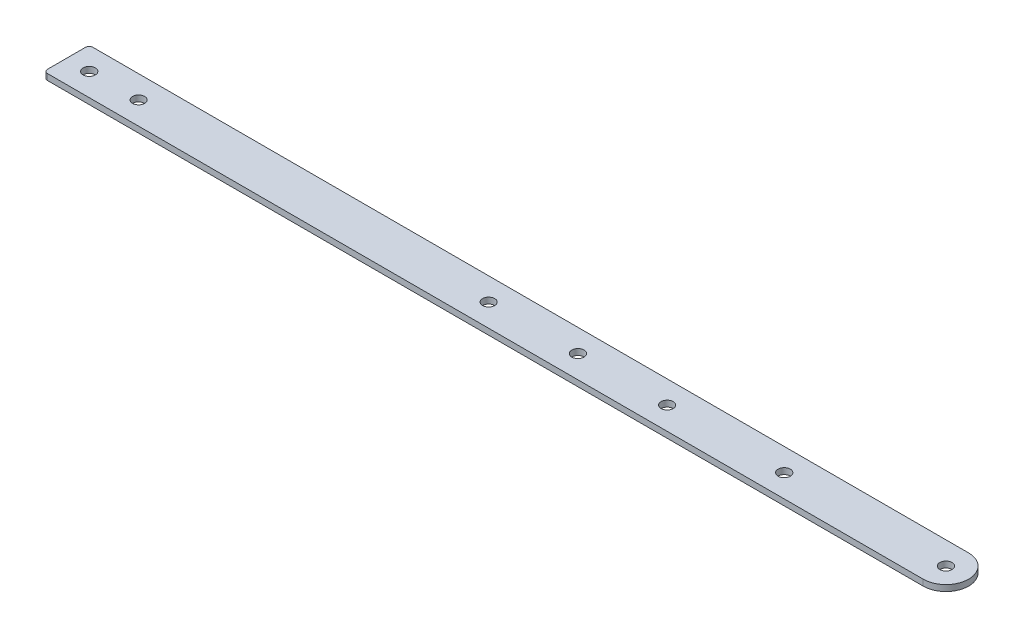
ISO-10303-21;
HEADER;
FILE_DESCRIPTION(('STEP AP214'),'2;1');
FILE_NAME('part.step','',(''),(''),'','','');
FILE_SCHEMA(('AUTOMOTIVE_DESIGN { 1 0 10303 214 1 1 1 1 }'));
ENDSEC;
DATA;
#1=APPLICATION_CONTEXT('core data for automotive mechanical design processes');
#2=APPLICATION_PROTOCOL_DEFINITION('international standard','automotive_design',2000,#1);
#3=PRODUCT_CONTEXT('',#1,'mechanical');
#4=PRODUCT('Part','Part','',(#3));
#5=PRODUCT_RELATED_PRODUCT_CATEGORY('part','',(#4));
#6=PRODUCT_DEFINITION_FORMATION('','',#4);
#7=PRODUCT_DEFINITION_CONTEXT('part definition',#1,'design');
#8=PRODUCT_DEFINITION('design','',#6,#7);
#9=PRODUCT_DEFINITION_SHAPE('','',#8);
#10=(LENGTH_UNIT() NAMED_UNIT(*) SI_UNIT(.MILLI.,.METRE.));
#11=(NAMED_UNIT(*) PLANE_ANGLE_UNIT() SI_UNIT($,.RADIAN.));
#12=(NAMED_UNIT(*) SI_UNIT($,.STERADIAN.) SOLID_ANGLE_UNIT());
#13=UNCERTAINTY_MEASURE_WITH_UNIT(LENGTH_MEASURE(1.E-05),#10,'distance_accuracy_value','');
#14=(GEOMETRIC_REPRESENTATION_CONTEXT(3) GLOBAL_UNCERTAINTY_ASSIGNED_CONTEXT((#13)) GLOBAL_UNIT_ASSIGNED_CONTEXT((#10,
#11,#12)) REPRESENTATION_CONTEXT('',''));
#15=CARTESIAN_POINT('',(0.,0.,0.));
#16=DIRECTION('',(0.,0.,1.));
#17=DIRECTION('',(1.,0.,0.));
#18=AXIS2_PLACEMENT_3D('',#15,#16,#17);
#19=CARTESIAN_POINT('',(1483.56169288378,4.,2004.05334639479));
#20=DIRECTION('',(0.,1.,0.));
#21=DIRECTION('',(0.,0.,-1.));
#22=AXIS2_PLACEMENT_3D('',#19,#20,#21);
#23=PLANE('',#22);
#24=CARTESIAN_POINT('',(1877.67003879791,4.,2016.55334639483));
#25=DIRECTION('',(0.,-1.,0.));
#26=DIRECTION('',(0.,0.,-1.));
#27=AXIS2_PLACEMENT_3D('',#24,#25,#26);
#28=CIRCLE('',#27,3.99999999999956);
#29=CARTESIAN_POINT('',(1877.67003879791,4.,2012.55334639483));
#30=VERTEX_POINT('',#29);
#31=EDGE_CURVE('E176',#30,#30,#28,.T.);
#32=ORIENTED_EDGE('',*,*,#31,.T.);
#33=EDGE_LOOP('',(#32));
#34=FACE_BOUND('',#33,.T.);
#35=CARTESIAN_POINT('',(1954.97920122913,4.,2016.55334639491));
#36=DIRECTION('',(0.,-1.,0.));
#37=DIRECTION('',(0.,0.,-1.));
#38=AXIS2_PLACEMENT_3D('',#35,#36,#37);
#39=CIRCLE('',#38,4.05000000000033);
#40=CARTESIAN_POINT('',(1954.97920122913,4.,2012.50334639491));
#41=VERTEX_POINT('',#40);
#42=EDGE_CURVE('E164',#41,#41,#39,.T.);
#43=ORIENTED_EDGE('',*,*,#42,.T.);
#44=EDGE_LOOP('',(#43));
#45=FACE_BOUND('',#44,.T.);
#46=CARTESIAN_POINT('',(1496.06169288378,4.,2016.5533463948));
#47=DIRECTION('',(0.,-1.,0.));
#48=DIRECTION('',(0.,0.,-1.));
#49=AXIS2_PLACEMENT_3D('',#46,#47,#48);
#50=CIRCLE('',#49,4.04999999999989);
#51=CARTESIAN_POINT('',(1496.06169288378,4.,2012.5033463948));
#52=VERTEX_POINT('',#51);
#53=EDGE_CURVE('E152',#52,#52,#50,.T.);
#54=ORIENTED_EDGE('',*,*,#53,.T.);
#55=EDGE_LOOP('',(#54));
#56=FACE_BOUND('',#55,.T.);
#57=CARTESIAN_POINT('',(1483.56169288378,4.,2004.05334639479));
#58=DIRECTION('',(0.,-1.,0.));
#59=DIRECTION('',(0.,0.,-1.));
#60=AXIS2_PLACEMENT_3D('',#57,#58,#59);
#61=CIRCLE('',#60,2.49999999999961);
#62=CARTESIAN_POINT('',(1481.06169288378,4.,2004.05334639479));
#63=VERTEX_POINT('',#62);
#64=CARTESIAN_POINT('',(1483.56169288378,4.,2001.55334639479));
#65=VERTEX_POINT('',#64);
#66=EDGE_CURVE('E135',#63,#65,#61,.T.);
#67=ORIENTED_EDGE('',*,*,#66,.F.);
#68=DIRECTION('',(0.,0.,-1.));
#69=VECTOR('',#68,1.);
#70=CARTESIAN_POINT('',(1481.06169288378,4.,2004.05334639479));
#71=LINE('',#70,#69);
#72=CARTESIAN_POINT('',(1481.06169288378,4.,2029.05334641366));
#73=VERTEX_POINT('',#72);
#74=EDGE_CURVE('E115',#73,#63,#71,.T.);
#75=ORIENTED_EDGE('',*,*,#74,.F.);
#76=CARTESIAN_POINT('',(1483.56169288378,4.,2029.05334641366));
#77=DIRECTION('',(0.,-1.,0.));
#78=DIRECTION('',(0.,0.,-1.));
#79=AXIS2_PLACEMENT_3D('',#76,#77,#78);
#80=CIRCLE('',#79,2.50000000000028);
#81=CARTESIAN_POINT('',(1483.56169288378,4.,2031.55334641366));
#82=VERTEX_POINT('',#81);
#83=EDGE_CURVE('E96',#82,#73,#80,.T.);
#84=ORIENTED_EDGE('',*,*,#83,.F.);
#85=DIRECTION('',(-1.,0.,0.));
#86=VECTOR('',#85,1.);
#87=CARTESIAN_POINT('',(1483.56169288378,4.,2031.55334641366));
#88=LINE('',#87,#86);
#89=CARTESIAN_POINT('',(2061.74711781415,4.,2031.55334641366));
#90=VERTEX_POINT('',#89);
#91=EDGE_CURVE('E106',#90,#82,#88,.T.);
#92=ORIENTED_EDGE('',*,*,#91,.F.);
#93=CARTESIAN_POINT('',(2061.74711782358,4.,2016.55334640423));
#94=DIRECTION('',(0.,-1.,0.));
#95=DIRECTION('',(0.,0.,-1.));
#96=AXIS2_PLACEMENT_3D('',#93,#94,#95);
#97=CIRCLE('',#96,15.0000000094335);
#98=CARTESIAN_POINT('',(2061.74711783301,4.,2001.55334639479));
#99=VERTEX_POINT('',#98);
#100=EDGE_CURVE('E111',#99,#90,#97,.T.);
#101=ORIENTED_EDGE('',*,*,#100,.F.);
#102=DIRECTION('',(1.,0.,0.));
#103=VECTOR('',#102,1.);
#104=CARTESIAN_POINT('',(1483.56169288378,4.,2001.55334639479));
#105=LINE('',#104,#103);
#106=EDGE_CURVE('E140',#65,#99,#105,.T.);
#107=ORIENTED_EDGE('',*,*,#106,.F.);
#108=EDGE_LOOP('',(#67,#75,#84,#92,#101,#107));
#109=FACE_BOUND('',#108,.T.);
#110=CARTESIAN_POINT('',(1528.6669663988,4.,2016.553346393));
#111=DIRECTION('',(0.,-1.,0.));
#112=DIRECTION('',(0.,0.,-1.));
#113=AXIS2_PLACEMENT_3D('',#110,#111,#112);
#114=CIRCLE('',#113,3.99999999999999);
#115=CARTESIAN_POINT('',(1528.6669663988,4.,2012.553346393));
#116=VERTEX_POINT('',#115);
#117=EDGE_CURVE('E124',#116,#116,#114,.T.);
#118=ORIENTED_EDGE('',*,*,#117,.T.);
#119=EDGE_LOOP('',(#118));
#120=FACE_BOUND('',#119,.T.);
#121=CARTESIAN_POINT('',(2061.74711782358,4.,2016.55334640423));
#122=DIRECTION('',(0.,-1.,0.));
#123=DIRECTION('',(0.,0.,-1.));
#124=AXIS2_PLACEMENT_3D('',#121,#122,#123);
#125=CIRCLE('',#124,4.04999999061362);
#126=CARTESIAN_POINT('',(2061.74711782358,4.,2012.50334641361));
#127=VERTEX_POINT('',#126);
#128=EDGE_CURVE('E158',#127,#127,#125,.T.);
#129=ORIENTED_EDGE('',*,*,#128,.T.);
#130=EDGE_LOOP('',(#129));
#131=FACE_BOUND('',#130,.T.);
#132=CARTESIAN_POINT('',(1818.75253045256,4.,2016.55334639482));
#133=DIRECTION('',(0.,-1.,0.));
#134=DIRECTION('',(0.,0.,-1.));
#135=AXIS2_PLACEMENT_3D('',#132,#133,#134);
#136=CIRCLE('',#135,4.04999999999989);
#137=CARTESIAN_POINT('',(1818.75253045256,4.,2012.50334639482));
#138=VERTEX_POINT('',#137);
#139=EDGE_CURVE('E170',#138,#138,#136,.T.);
#140=ORIENTED_EDGE('',*,*,#139,.T.);
#141=EDGE_LOOP('',(#140));
#142=FACE_BOUND('',#141,.T.);
#143=CARTESIAN_POINT('',(1759.83502210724,4.,2016.55334639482));
#144=DIRECTION('',(0.,-1.,0.));
#145=DIRECTION('',(0.,0.,-1.));
#146=AXIS2_PLACEMENT_3D('',#143,#144,#145);
#147=CIRCLE('',#146,4.);
#148=CARTESIAN_POINT('',(1759.83502210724,4.,2012.55334639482));
#149=VERTEX_POINT('',#148);
#150=EDGE_CURVE('E182',#149,#149,#147,.T.);
#151=ORIENTED_EDGE('',*,*,#150,.T.);
#152=EDGE_LOOP('',(#151));
#153=FACE_BOUND('',#152,.T.);
#154=ADVANCED_FACE('F35',(#34,#45,#56,#109,#120,#131,#142,#153),#23,.T.);
#155=CARTESIAN_POINT('',(1483.56169288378,0.,2004.05334639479));
#156=DIRECTION('',(0.,1.,0.));
#157=DIRECTION('',(0.,0.,-1.));
#158=AXIS2_PLACEMENT_3D('',#155,#156,#157);
#159=PLANE('',#158);
#160=CARTESIAN_POINT('',(1877.67003879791,0.,2016.55334639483));
#161=DIRECTION('',(0.,-1.,0.));
#162=DIRECTION('',(0.,0.,-1.));
#163=AXIS2_PLACEMENT_3D('',#160,#161,#162);
#164=CIRCLE('',#163,3.99999999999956);
#165=CARTESIAN_POINT('',(1877.67003879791,0.,2012.55334639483));
#166=VERTEX_POINT('',#165);
#167=EDGE_CURVE('E179',#166,#166,#164,.T.);
#168=ORIENTED_EDGE('',*,*,#167,.F.);
#169=EDGE_LOOP('',(#168));
#170=FACE_BOUND('',#169,.T.);
#171=CARTESIAN_POINT('',(1954.97920122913,0.,2016.55334639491));
#172=DIRECTION('',(0.,-1.,0.));
#173=DIRECTION('',(0.,0.,-1.));
#174=AXIS2_PLACEMENT_3D('',#171,#172,#173);
#175=CIRCLE('',#174,4.05000000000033);
#176=CARTESIAN_POINT('',(1954.97920122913,0.,2012.50334639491));
#177=VERTEX_POINT('',#176);
#178=EDGE_CURVE('E167',#177,#177,#175,.T.);
#179=ORIENTED_EDGE('',*,*,#178,.F.);
#180=EDGE_LOOP('',(#179));
#181=FACE_BOUND('',#180,.T.);
#182=CARTESIAN_POINT('',(1496.06169288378,0.,2016.5533463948));
#183=DIRECTION('',(0.,-1.,0.));
#184=DIRECTION('',(0.,0.,-1.));
#185=AXIS2_PLACEMENT_3D('',#182,#183,#184);
#186=CIRCLE('',#185,4.04999999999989);
#187=CARTESIAN_POINT('',(1496.06169288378,0.,2012.5033463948));
#188=VERTEX_POINT('',#187);
#189=EDGE_CURVE('E155',#188,#188,#186,.T.);
#190=ORIENTED_EDGE('',*,*,#189,.F.);
#191=EDGE_LOOP('',(#190));
#192=FACE_BOUND('',#191,.T.);
#193=CARTESIAN_POINT('',(1483.56169288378,0.,2004.05334639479));
#194=DIRECTION('',(0.,-1.,0.));
#195=DIRECTION('',(0.,0.,-1.));
#196=AXIS2_PLACEMENT_3D('',#193,#194,#195);
#197=CIRCLE('',#196,2.49999999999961);
#198=CARTESIAN_POINT('',(1481.06169288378,0.,2004.05334639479));
#199=VERTEX_POINT('',#198);
#200=CARTESIAN_POINT('',(1483.56169288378,0.,2001.55334639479));
#201=VERTEX_POINT('',#200);
#202=EDGE_CURVE('E120',#199,#201,#197,.T.);
#203=ORIENTED_EDGE('',*,*,#202,.T.);
#204=DIRECTION('',(1.,0.,0.));
#205=VECTOR('',#204,1.);
#206=CARTESIAN_POINT('',(1483.56169288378,0.,2001.55334639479));
#207=LINE('',#206,#205);
#208=CARTESIAN_POINT('',(2061.74711783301,0.,2001.55334639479));
#209=VERTEX_POINT('',#208);
#210=EDGE_CURVE('E123',#201,#209,#207,.T.);
#211=ORIENTED_EDGE('',*,*,#210,.T.);
#212=CARTESIAN_POINT('',(2061.74711782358,0.,2016.55334640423));
#213=DIRECTION('',(0.,-1.,0.));
#214=DIRECTION('',(0.,0.,-1.));
#215=AXIS2_PLACEMENT_3D('',#212,#213,#214);
#216=CIRCLE('',#215,15.0000000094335);
#217=CARTESIAN_POINT('',(2061.74711781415,0.,2031.55334641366));
#218=VERTEX_POINT('',#217);
#219=EDGE_CURVE('E127',#209,#218,#216,.T.);
#220=ORIENTED_EDGE('',*,*,#219,.T.);
#221=DIRECTION('',(-1.,0.,0.));
#222=VECTOR('',#221,1.);
#223=CARTESIAN_POINT('',(1483.56169288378,0.,2031.55334641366));
#224=LINE('',#223,#222);
#225=CARTESIAN_POINT('',(1483.56169288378,0.,2031.55334641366));
#226=VERTEX_POINT('',#225);
#227=EDGE_CURVE('E130',#218,#226,#224,.T.);
#228=ORIENTED_EDGE('',*,*,#227,.T.);
#229=CARTESIAN_POINT('',(1483.56169288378,0.,2029.05334641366));
#230=DIRECTION('',(0.,-1.,0.));
#231=DIRECTION('',(0.,0.,-1.));
#232=AXIS2_PLACEMENT_3D('',#229,#230,#231);
#233=CIRCLE('',#232,2.50000000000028);
#234=CARTESIAN_POINT('',(1481.06169288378,0.,2029.05334641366));
#235=VERTEX_POINT('',#234);
#236=EDGE_CURVE('E99',#226,#235,#233,.T.);
#237=ORIENTED_EDGE('',*,*,#236,.T.);
#238=DIRECTION('',(0.,0.,-1.));
#239=VECTOR('',#238,1.);
#240=CARTESIAN_POINT('',(1481.06169288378,0.,2004.05334639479));
#241=LINE('',#240,#239);
#242=EDGE_CURVE('E133',#235,#199,#241,.T.);
#243=ORIENTED_EDGE('',*,*,#242,.T.);
#244=EDGE_LOOP('',(#203,#211,#220,#228,#237,#243));
#245=FACE_BOUND('',#244,.T.);
#246=CARTESIAN_POINT('',(1528.6669663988,0.,2016.553346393));
#247=DIRECTION('',(0.,-1.,0.));
#248=DIRECTION('',(0.,0.,-1.));
#249=AXIS2_PLACEMENT_3D('',#246,#247,#248);
#250=CIRCLE('',#249,3.99999999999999);
#251=CARTESIAN_POINT('',(1528.6669663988,0.,2012.553346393));
#252=VERTEX_POINT('',#251);
#253=EDGE_CURVE('E149',#252,#252,#250,.T.);
#254=ORIENTED_EDGE('',*,*,#253,.F.);
#255=EDGE_LOOP('',(#254));
#256=FACE_BOUND('',#255,.T.);
#257=CARTESIAN_POINT('',(2061.74711782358,0.,2016.55334640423));
#258=DIRECTION('',(0.,-1.,0.));
#259=DIRECTION('',(0.,0.,-1.));
#260=AXIS2_PLACEMENT_3D('',#257,#258,#259);
#261=CIRCLE('',#260,4.04999999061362);
#262=CARTESIAN_POINT('',(2061.74711782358,0.,2012.50334641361));
#263=VERTEX_POINT('',#262);
#264=EDGE_CURVE('E161',#263,#263,#261,.T.);
#265=ORIENTED_EDGE('',*,*,#264,.F.);
#266=EDGE_LOOP('',(#265));
#267=FACE_BOUND('',#266,.T.);
#268=CARTESIAN_POINT('',(1818.75253045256,0.,2016.55334639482));
#269=DIRECTION('',(0.,-1.,0.));
#270=DIRECTION('',(0.,0.,-1.));
#271=AXIS2_PLACEMENT_3D('',#268,#269,#270);
#272=CIRCLE('',#271,4.04999999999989);
#273=CARTESIAN_POINT('',(1818.75253045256,0.,2012.50334639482));
#274=VERTEX_POINT('',#273);
#275=EDGE_CURVE('E173',#274,#274,#272,.T.);
#276=ORIENTED_EDGE('',*,*,#275,.F.);
#277=EDGE_LOOP('',(#276));
#278=FACE_BOUND('',#277,.T.);
#279=CARTESIAN_POINT('',(1759.83502210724,0.,2016.55334639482));
#280=DIRECTION('',(0.,-1.,0.));
#281=DIRECTION('',(0.,0.,-1.));
#282=AXIS2_PLACEMENT_3D('',#279,#280,#281);
#283=CIRCLE('',#282,4.);
#284=CARTESIAN_POINT('',(1759.83502210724,0.,2012.55334639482));
#285=VERTEX_POINT('',#284);
#286=EDGE_CURVE('E185',#285,#285,#283,.T.);
#287=ORIENTED_EDGE('',*,*,#286,.F.);
#288=EDGE_LOOP('',(#287));
#289=FACE_BOUND('',#288,.T.);
#290=ADVANCED_FACE('F144',(#170,#181,#192,#245,#256,#267,#278,#289),#159,.F.);
#291=CARTESIAN_POINT('',(1483.56169288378,4.,2004.05334639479));
#292=DIRECTION('',(0.,-1.,0.));
#293=DIRECTION('',(0.,0.,1.));
#294=AXIS2_PLACEMENT_3D('',#291,#292,#293);
#295=CYLINDRICAL_SURFACE('',#294,2.49999999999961);
#296=ORIENTED_EDGE('',*,*,#202,.F.);
#297=DIRECTION('',(0.,-1.,0.));
#298=VECTOR('',#297,1.);
#299=CARTESIAN_POINT('',(1481.06169288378,4.,2004.05334639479));
#300=LINE('',#299,#298);
#301=EDGE_CURVE('E52',#63,#199,#300,.T.);
#302=ORIENTED_EDGE('',*,*,#301,.F.);
#303=ORIENTED_EDGE('',*,*,#66,.T.);
#304=DIRECTION('',(0.,-1.,0.));
#305=VECTOR('',#304,1.);
#306=CARTESIAN_POINT('',(1483.56169288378,4.,2001.55334639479));
#307=LINE('',#306,#305);
#308=EDGE_CURVE('E11',#65,#201,#307,.T.);
#309=ORIENTED_EDGE('',*,*,#308,.T.);
#310=EDGE_LOOP('',(#296,#302,#303,#309));
#311=FACE_BOUND('',#310,.T.);
#312=ADVANCED_FACE('F37',(#311),#295,.T.);
#313=CARTESIAN_POINT('',(1483.56169288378,4.,2001.55334639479));
#314=DIRECTION('',(0.,0.,1.));
#315=DIRECTION('',(-1.,0.,0.));
#316=AXIS2_PLACEMENT_3D('',#313,#314,#315);
#317=PLANE('',#316);
#318=ORIENTED_EDGE('',*,*,#210,.F.);
#319=ORIENTED_EDGE('',*,*,#308,.F.);
#320=ORIENTED_EDGE('',*,*,#106,.T.);
#321=DIRECTION('',(0.,-1.,0.));
#322=VECTOR('',#321,1.);
#323=CARTESIAN_POINT('',(2061.74711783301,4.,2001.55334639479));
#324=LINE('',#323,#322);
#325=EDGE_CURVE('E44',#99,#209,#324,.T.);
#326=ORIENTED_EDGE('',*,*,#325,.T.);
#327=EDGE_LOOP('',(#318,#319,#320,#326));
#328=FACE_BOUND('',#327,.T.);
#329=ADVANCED_FACE('F139',(#328),#317,.F.);
#330=CARTESIAN_POINT('',(2061.74711782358,4.,2016.55334640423));
#331=DIRECTION('',(0.,-1.,0.));
#332=DIRECTION('',(0.,0.,1.));
#333=AXIS2_PLACEMENT_3D('',#330,#331,#332);
#334=CYLINDRICAL_SURFACE('',#333,15.0000000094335);
#335=ORIENTED_EDGE('',*,*,#219,.F.);
#336=ORIENTED_EDGE('',*,*,#325,.F.);
#337=ORIENTED_EDGE('',*,*,#100,.T.);
#338=DIRECTION('',(0.,-1.,0.));
#339=VECTOR('',#338,1.);
#340=CARTESIAN_POINT('',(2061.74711781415,4.,2031.55334641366));
#341=LINE('',#340,#339);
#342=EDGE_CURVE('E103',#90,#218,#341,.T.);
#343=ORIENTED_EDGE('',*,*,#342,.T.);
#344=EDGE_LOOP('',(#335,#336,#337,#343));
#345=FACE_BOUND('',#344,.T.);
#346=ADVANCED_FACE('F142',(#345),#334,.T.);
#347=CARTESIAN_POINT('',(1483.56169288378,4.,2031.55334641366));
#348=DIRECTION('',(0.,0.,-1.));
#349=DIRECTION('',(1.,0.,0.));
#350=AXIS2_PLACEMENT_3D('',#347,#348,#349);
#351=PLANE('',#350);
#352=ORIENTED_EDGE('',*,*,#227,.F.);
#353=ORIENTED_EDGE('',*,*,#342,.F.);
#354=ORIENTED_EDGE('',*,*,#91,.T.);
#355=DIRECTION('',(0.,-1.,0.));
#356=VECTOR('',#355,1.);
#357=CARTESIAN_POINT('',(1483.56169288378,4.,2031.55334641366));
#358=LINE('',#357,#356);
#359=EDGE_CURVE('E92',#82,#226,#358,.T.);
#360=ORIENTED_EDGE('',*,*,#359,.T.);
#361=EDGE_LOOP('',(#352,#353,#354,#360));
#362=FACE_BOUND('',#361,.T.);
#363=ADVANCED_FACE('F107',(#362),#351,.F.);
#364=CARTESIAN_POINT('',(1483.56169288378,4.,2029.05334641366));
#365=DIRECTION('',(0.,-1.,0.));
#366=DIRECTION('',(0.,0.,1.));
#367=AXIS2_PLACEMENT_3D('',#364,#365,#366);
#368=CYLINDRICAL_SURFACE('',#367,2.50000000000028);
#369=ORIENTED_EDGE('',*,*,#236,.F.);
#370=ORIENTED_EDGE('',*,*,#359,.F.);
#371=ORIENTED_EDGE('',*,*,#83,.T.);
#372=DIRECTION('',(0.,-1.,0.));
#373=VECTOR('',#372,1.);
#374=CARTESIAN_POINT('',(1481.06169288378,4.,2029.05334641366));
#375=LINE('',#374,#373);
#376=EDGE_CURVE('E74',#73,#235,#375,.T.);
#377=ORIENTED_EDGE('',*,*,#376,.T.);
#378=EDGE_LOOP('',(#369,#370,#371,#377));
#379=FACE_BOUND('',#378,.T.);
#380=ADVANCED_FACE('F94',(#379),#368,.T.);
#381=CARTESIAN_POINT('',(1481.06169288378,4.,2004.05334639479));
#382=DIRECTION('',(1.,0.,0.));
#383=DIRECTION('',(0.,0.,1.));
#384=AXIS2_PLACEMENT_3D('',#381,#382,#383);
#385=PLANE('',#384);
#386=ORIENTED_EDGE('',*,*,#242,.F.);
#387=ORIENTED_EDGE('',*,*,#376,.F.);
#388=ORIENTED_EDGE('',*,*,#74,.T.);
#389=ORIENTED_EDGE('',*,*,#301,.T.);
#390=EDGE_LOOP('',(#386,#387,#388,#389));
#391=FACE_BOUND('',#390,.T.);
#392=ADVANCED_FACE('F212',(#391),#385,.F.);
#393=CARTESIAN_POINT('',(1528.6669663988,4.,2016.553346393));
#394=DIRECTION('',(0.,-1.,0.));
#395=DIRECTION('',(0.,0.,1.));
#396=AXIS2_PLACEMENT_3D('',#393,#394,#395);
#397=CYLINDRICAL_SURFACE('',#396,3.99999999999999);
#398=ORIENTED_EDGE('',*,*,#117,.F.);
#399=EDGE_LOOP('',(#398));
#400=FACE_BOUND('',#399,.T.);
#401=ORIENTED_EDGE('',*,*,#253,.T.);
#402=EDGE_LOOP('',(#401));
#403=FACE_BOUND('',#402,.T.);
#404=ADVANCED_FACE('F215',(#400,#403),#397,.F.);
#405=CARTESIAN_POINT('',(1496.06169288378,4.,2016.5533463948));
#406=DIRECTION('',(0.,-1.,0.));
#407=DIRECTION('',(0.,0.,1.));
#408=AXIS2_PLACEMENT_3D('',#405,#406,#407);
#409=CYLINDRICAL_SURFACE('',#408,4.04999999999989);
#410=ORIENTED_EDGE('',*,*,#53,.F.);
#411=EDGE_LOOP('',(#410));
#412=FACE_BOUND('',#411,.T.);
#413=ORIENTED_EDGE('',*,*,#189,.T.);
#414=EDGE_LOOP('',(#413));
#415=FACE_BOUND('',#414,.T.);
#416=ADVANCED_FACE('F248',(#412,#415),#409,.F.);
#417=CARTESIAN_POINT('',(2061.74711782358,4.,2016.55334640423));
#418=DIRECTION('',(0.,-1.,0.));
#419=DIRECTION('',(0.,0.,1.));
#420=AXIS2_PLACEMENT_3D('',#417,#418,#419);
#421=CYLINDRICAL_SURFACE('',#420,4.04999999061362);
#422=ORIENTED_EDGE('',*,*,#128,.F.);
#423=EDGE_LOOP('',(#422));
#424=FACE_BOUND('',#423,.T.);
#425=ORIENTED_EDGE('',*,*,#264,.T.);
#426=EDGE_LOOP('',(#425));
#427=FACE_BOUND('',#426,.T.);
#428=ADVANCED_FACE('F255',(#424,#427),#421,.F.);
#429=CARTESIAN_POINT('',(1954.97920122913,4.,2016.55334639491));
#430=DIRECTION('',(0.,-1.,0.));
#431=DIRECTION('',(0.,0.,1.));
#432=AXIS2_PLACEMENT_3D('',#429,#430,#431);
#433=CYLINDRICAL_SURFACE('',#432,4.05000000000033);
#434=ORIENTED_EDGE('',*,*,#42,.F.);
#435=EDGE_LOOP('',(#434));
#436=FACE_BOUND('',#435,.T.);
#437=ORIENTED_EDGE('',*,*,#178,.T.);
#438=EDGE_LOOP('',(#437));
#439=FACE_BOUND('',#438,.T.);
#440=ADVANCED_FACE('F263',(#436,#439),#433,.F.);
#441=CARTESIAN_POINT('',(1818.75253045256,4.,2016.55334639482));
#442=DIRECTION('',(0.,-1.,0.));
#443=DIRECTION('',(0.,0.,1.));
#444=AXIS2_PLACEMENT_3D('',#441,#442,#443);
#445=CYLINDRICAL_SURFACE('',#444,4.04999999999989);
#446=ORIENTED_EDGE('',*,*,#139,.F.);
#447=EDGE_LOOP('',(#446));
#448=FACE_BOUND('',#447,.T.);
#449=ORIENTED_EDGE('',*,*,#275,.T.);
#450=EDGE_LOOP('',(#449));
#451=FACE_BOUND('',#450,.T.);
#452=ADVANCED_FACE('F271',(#448,#451),#445,.F.);
#453=CARTESIAN_POINT('',(1877.67003879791,4.,2016.55334639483));
#454=DIRECTION('',(0.,-1.,0.));
#455=DIRECTION('',(0.,0.,1.));
#456=AXIS2_PLACEMENT_3D('',#453,#454,#455);
#457=CYLINDRICAL_SURFACE('',#456,3.99999999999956);
#458=ORIENTED_EDGE('',*,*,#31,.F.);
#459=EDGE_LOOP('',(#458));
#460=FACE_BOUND('',#459,.T.);
#461=ORIENTED_EDGE('',*,*,#167,.T.);
#462=EDGE_LOOP('',(#461));
#463=FACE_BOUND('',#462,.T.);
#464=ADVANCED_FACE('F195',(#460,#463),#457,.F.);
#465=CARTESIAN_POINT('',(1759.83502210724,4.,2016.55334639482));
#466=DIRECTION('',(0.,-1.,0.));
#467=DIRECTION('',(0.,0.,1.));
#468=AXIS2_PLACEMENT_3D('',#465,#466,#467);
#469=CYLINDRICAL_SURFACE('',#468,4.);
#470=ORIENTED_EDGE('',*,*,#150,.F.);
#471=EDGE_LOOP('',(#470));
#472=FACE_BOUND('',#471,.T.);
#473=ORIENTED_EDGE('',*,*,#286,.T.);
#474=EDGE_LOOP('',(#473));
#475=FACE_BOUND('',#474,.T.);
#476=ADVANCED_FACE('F192',(#472,#475),#469,.F.);
#477=CLOSED_SHELL('',(#154,#290,#312,#329,#346,#363,#380,#392,#404,#416,#428,#440,#452,#464,#476));
#478=MANIFOLD_SOLID_BREP('B2',#477);
#479=ADVANCED_BREP_SHAPE_REPRESENTATION('',(#18,#478),#14);
#480=SHAPE_DEFINITION_REPRESENTATION(#9,#479);
ENDSEC;
END-ISO-10303-21;
